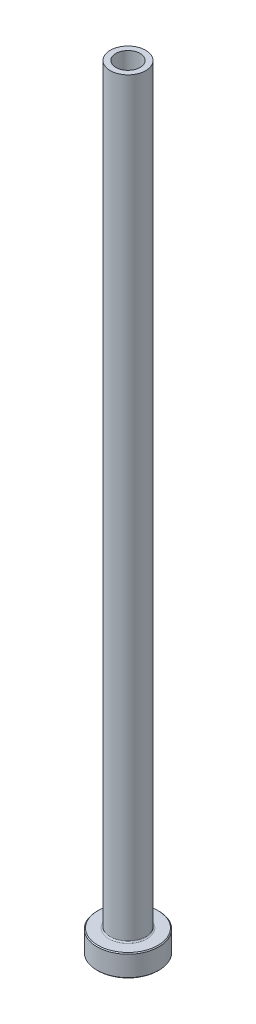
ISO-10303-21;
HEADER;
FILE_DESCRIPTION(('STEP AP214'),'2;1');
FILE_NAME('part.step','',(''),(''),'','','');
FILE_SCHEMA(('AUTOMOTIVE_DESIGN { 1 0 10303 214 1 1 1 1 }'));
ENDSEC;
DATA;
#1=APPLICATION_CONTEXT('core data for automotive mechanical design processes');
#2=APPLICATION_PROTOCOL_DEFINITION('international standard','automotive_design',2000,#1);
#3=PRODUCT_CONTEXT('',#1,'mechanical');
#4=PRODUCT('Part','Part','',(#3));
#5=PRODUCT_RELATED_PRODUCT_CATEGORY('part','',(#4));
#6=PRODUCT_DEFINITION_FORMATION('','',#4);
#7=PRODUCT_DEFINITION_CONTEXT('part definition',#1,'design');
#8=PRODUCT_DEFINITION('design','',#6,#7);
#9=PRODUCT_DEFINITION_SHAPE('','',#8);
#10=(LENGTH_UNIT() NAMED_UNIT(*) SI_UNIT(.MILLI.,.METRE.));
#11=(NAMED_UNIT(*) PLANE_ANGLE_UNIT() SI_UNIT($,.RADIAN.));
#12=(NAMED_UNIT(*) SI_UNIT($,.STERADIAN.) SOLID_ANGLE_UNIT());
#13=UNCERTAINTY_MEASURE_WITH_UNIT(LENGTH_MEASURE(1.E-05),#10,'distance_accuracy_value','');
#14=(GEOMETRIC_REPRESENTATION_CONTEXT(3) GLOBAL_UNCERTAINTY_ASSIGNED_CONTEXT((#13)) GLOBAL_UNIT_ASSIGNED_CONTEXT((#10,
#11,#12)) REPRESENTATION_CONTEXT('',''));
#15=CARTESIAN_POINT('',(0.,0.,0.));
#16=DIRECTION('',(0.,0.,1.));
#17=DIRECTION('',(1.,0.,0.));
#18=AXIS2_PLACEMENT_3D('',#15,#16,#17);
#19=CARTESIAN_POINT('',(0.,92.1876809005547,0.));
#20=DIRECTION('',(0.,1.,0.));
#21=DIRECTION('',(0.,0.,1.));
#22=AXIS2_PLACEMENT_3D('',#19,#20,#21);
#23=CYLINDRICAL_SURFACE('',#22,2.75);
#24=CARTESIAN_POINT('',(0.,175.,0.));
#25=DIRECTION('',(0.,1.,0.));
#26=DIRECTION('',(0.,0.,1.));
#27=AXIS2_PLACEMENT_3D('',#24,#25,#26);
#28=CIRCLE('',#27,2.75);
#29=CARTESIAN_POINT('',(0.,175.,2.75));
#30=VERTEX_POINT('',#29);
#31=EDGE_CURVE('E62',#30,#30,#28,.T.);
#32=ORIENTED_EDGE('',*,*,#31,.T.);
#33=EDGE_LOOP('',(#32));
#34=FACE_BOUND('',#33,.T.);
#35=CARTESIAN_POINT('',(0.,130.,0.));
#36=DIRECTION('',(0.,1.,0.));
#37=DIRECTION('',(0.,0.,1.));
#38=AXIS2_PLACEMENT_3D('',#35,#36,#37);
#39=CIRCLE('',#38,2.75);
#40=CARTESIAN_POINT('',(0.,130.,2.75));
#41=VERTEX_POINT('',#40);
#42=EDGE_CURVE('E71',#41,#41,#39,.T.);
#43=ORIENTED_EDGE('',*,*,#42,.F.);
#44=EDGE_LOOP('',(#43));
#45=FACE_BOUND('',#44,.T.);
#46=ADVANCED_FACE('F30',(#34,#45),#23,.F.);
#47=CARTESIAN_POINT('',(-2.75,175.,0.));
#48=DIRECTION('',(0.,1.,0.));
#49=DIRECTION('',(0.,0.,1.));
#50=AXIS2_PLACEMENT_3D('',#47,#48,#49);
#51=PLANE('',#50);
#52=CARTESIAN_POINT('',(0.,175.,0.));
#53=DIRECTION('',(0.,1.,0.));
#54=DIRECTION('',(0.,0.,1.));
#55=AXIS2_PLACEMENT_3D('',#52,#53,#54);
#56=CIRCLE('',#55,4.00000000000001);
#57=CARTESIAN_POINT('',(0.,175.,4.00000000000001));
#58=VERTEX_POINT('',#57);
#59=EDGE_CURVE('E65',#58,#58,#56,.T.);
#60=ORIENTED_EDGE('',*,*,#59,.T.);
#61=EDGE_LOOP('',(#60));
#62=FACE_BOUND('',#61,.T.);
#63=ORIENTED_EDGE('',*,*,#31,.F.);
#64=EDGE_LOOP('',(#63));
#65=FACE_BOUND('',#64,.T.);
#66=ADVANCED_FACE('F79',(#62,#65),#51,.T.);
#67=CARTESIAN_POINT('',(0.,92.1876809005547,0.));
#68=DIRECTION('',(0.,1.,0.));
#69=DIRECTION('',(0.,0.,1.));
#70=AXIS2_PLACEMENT_3D('',#67,#68,#69);
#71=CYLINDRICAL_SURFACE('',#70,4.);
#72=CARTESIAN_POINT('',(0.,5.3,0.));
#73=DIRECTION('',(0.,1.,0.));
#74=DIRECTION('',(0.,0.,1.));
#75=AXIS2_PLACEMENT_3D('',#72,#73,#74);
#76=CIRCLE('',#75,4.);
#77=CARTESIAN_POINT('',(0.,5.3,4.));
#78=VERTEX_POINT('',#77);
#79=EDGE_CURVE('E59',#78,#78,#76,.T.);
#80=ORIENTED_EDGE('',*,*,#79,.T.);
#81=EDGE_LOOP('',(#80));
#82=FACE_BOUND('',#81,.T.);
#83=ORIENTED_EDGE('',*,*,#59,.F.);
#84=EDGE_LOOP('',(#83));
#85=FACE_BOUND('',#84,.T.);
#86=ADVANCED_FACE('F85',(#82,#85),#71,.T.);
#87=CARTESIAN_POINT('',(-3.99999999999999,5.,0.));
#88=DIRECTION('',(0.,1.,0.));
#89=DIRECTION('',(0.,0.,1.));
#90=AXIS2_PLACEMENT_3D('',#87,#88,#89);
#91=PLANE('',#90);
#92=CARTESIAN_POINT('',(0.,5.,0.));
#93=DIRECTION('',(0.,1.,0.));
#94=DIRECTION('',(0.,0.,1.));
#95=AXIS2_PLACEMENT_3D('',#92,#93,#94);
#96=CIRCLE('',#95,6.79999999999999);
#97=CARTESIAN_POINT('',(0.,5.,6.79999999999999));
#98=VERTEX_POINT('',#97);
#99=EDGE_CURVE('E53',#98,#98,#96,.T.);
#100=ORIENTED_EDGE('',*,*,#99,.T.);
#101=EDGE_LOOP('',(#100));
#102=FACE_BOUND('',#101,.T.);
#103=CARTESIAN_POINT('',(0.,5.,0.));
#104=DIRECTION('',(0.,1.,0.));
#105=DIRECTION('',(0.,0.,1.));
#106=AXIS2_PLACEMENT_3D('',#103,#104,#105);
#107=CIRCLE('',#106,4.3);
#108=CARTESIAN_POINT('',(0.,5.,4.3));
#109=VERTEX_POINT('',#108);
#110=EDGE_CURVE('E56',#109,#109,#107,.F.);
#111=ORIENTED_EDGE('',*,*,#110,.T.);
#112=EDGE_LOOP('',(#111));
#113=FACE_BOUND('',#112,.T.);
#114=ADVANCED_FACE('F111',(#102,#113),#91,.T.);
#115=CARTESIAN_POINT('',(0.,92.1876809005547,0.));
#116=DIRECTION('',(0.,1.,0.));
#117=DIRECTION('',(0.,0.,1.));
#118=AXIS2_PLACEMENT_3D('',#115,#116,#117);
#119=CYLINDRICAL_SURFACE('',#118,6.99999999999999);
#120=CARTESIAN_POINT('',(0.,4.79999999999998,0.));
#121=DIRECTION('',(0.,1.,0.));
#122=DIRECTION('',(0.,0.,1.));
#123=AXIS2_PLACEMENT_3D('',#120,#121,#122);
#124=CIRCLE('',#123,6.99999999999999);
#125=CARTESIAN_POINT('',(0.,4.79999999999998,6.99999999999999));
#126=VERTEX_POINT('',#125);
#127=EDGE_CURVE('E45',#126,#126,#124,.F.);
#128=ORIENTED_EDGE('',*,*,#127,.T.);
#129=EDGE_LOOP('',(#128));
#130=FACE_BOUND('',#129,.T.);
#131=CARTESIAN_POINT('',(0.,0.20000000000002,0.));
#132=DIRECTION('',(0.,-1.,0.));
#133=DIRECTION('',(0.,0.,-1.));
#134=AXIS2_PLACEMENT_3D('',#131,#132,#133);
#135=CIRCLE('',#134,6.99999999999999);
#136=CARTESIAN_POINT('',(0.,0.20000000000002,-6.99999999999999));
#137=VERTEX_POINT('',#136);
#138=EDGE_CURVE('E50',#137,#137,#135,.F.);
#139=ORIENTED_EDGE('',*,*,#138,.T.);
#140=EDGE_LOOP('',(#139));
#141=FACE_BOUND('',#140,.T.);
#142=ADVANCED_FACE('F108',(#130,#141),#119,.T.);
#143=CARTESIAN_POINT('',(-6.99999999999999,0.,0.));
#144=DIRECTION('',(0.,-1.,0.));
#145=DIRECTION('',(0.,0.,-1.));
#146=AXIS2_PLACEMENT_3D('',#143,#144,#145);
#147=PLANE('',#146);
#148=CARTESIAN_POINT('',(0.,0.,0.));
#149=DIRECTION('',(0.,-1.,0.));
#150=DIRECTION('',(0.,0.,-1.));
#151=AXIS2_PLACEMENT_3D('',#148,#149,#150);
#152=CIRCLE('',#151,3.49999999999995);
#153=CARTESIAN_POINT('',(0.,0.,-3.49999999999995));
#154=VERTEX_POINT('',#153);
#155=EDGE_CURVE('E37',#154,#154,#152,.F.);
#156=ORIENTED_EDGE('',*,*,#155,.T.);
#157=EDGE_LOOP('',(#156));
#158=FACE_BOUND('',#157,.T.);
#159=CARTESIAN_POINT('',(0.,0.,0.));
#160=DIRECTION('',(0.,-1.,0.));
#161=DIRECTION('',(0.,0.,-1.));
#162=AXIS2_PLACEMENT_3D('',#159,#160,#161);
#163=CIRCLE('',#162,6.79999999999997);
#164=CARTESIAN_POINT('',(0.,0.,-6.79999999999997));
#165=VERTEX_POINT('',#164);
#166=EDGE_CURVE('E41',#165,#165,#163,.T.);
#167=ORIENTED_EDGE('',*,*,#166,.T.);
#168=EDGE_LOOP('',(#167));
#169=FACE_BOUND('',#168,.T.);
#170=ADVANCED_FACE('F110',(#158,#169),#147,.T.);
#171=CARTESIAN_POINT('',(0.,92.1876809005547,0.));
#172=DIRECTION('',(0.,1.,0.));
#173=DIRECTION('',(0.,0.,1.));
#174=AXIS2_PLACEMENT_3D('',#171,#172,#173);
#175=CYLINDRICAL_SURFACE('',#174,3.);
#176=CARTESIAN_POINT('',(0.,0.499999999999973,0.));
#177=DIRECTION('',(0.,-1.,0.));
#178=DIRECTION('',(0.,0.,-1.));
#179=AXIS2_PLACEMENT_3D('',#176,#177,#178);
#180=CIRCLE('',#179,3.);
#181=CARTESIAN_POINT('',(0.,0.499999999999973,-3.));
#182=VERTEX_POINT('',#181);
#183=EDGE_CURVE('E10',#182,#182,#180,.T.);
#184=ORIENTED_EDGE('',*,*,#183,.T.);
#185=EDGE_LOOP('',(#184));
#186=FACE_BOUND('',#185,.T.);
#187=CARTESIAN_POINT('',(0.,118.,0.));
#188=DIRECTION('',(0.,1.,0.));
#189=DIRECTION('',(0.,0.,1.));
#190=AXIS2_PLACEMENT_3D('',#187,#188,#189);
#191=CIRCLE('',#190,3.);
#192=CARTESIAN_POINT('',(0.,118.,3.));
#193=VERTEX_POINT('',#192);
#194=EDGE_CURVE('E68',#193,#193,#191,.T.);
#195=ORIENTED_EDGE('',*,*,#194,.T.);
#196=EDGE_LOOP('',(#195));
#197=FACE_BOUND('',#196,.T.);
#198=ADVANCED_FACE('F118',(#186,#197),#175,.F.);
#199=CARTESIAN_POINT('',(0.,118.,0.));
#200=DIRECTION('',(0.,-1.,0.));
#201=DIRECTION('',(0.,0.,-1.));
#202=AXIS2_PLACEMENT_3D('',#199,#200,#201);
#203=CONICAL_SURFACE('',#202,3.,0.0208303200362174);
#204=ORIENTED_EDGE('',*,*,#42,.T.);
#205=EDGE_LOOP('',(#204));
#206=FACE_BOUND('',#205,.T.);
#207=ORIENTED_EDGE('',*,*,#194,.F.);
#208=EDGE_LOOP('',(#207));
#209=FACE_BOUND('',#208,.T.);
#210=ADVANCED_FACE('F75',(#206,#209),#203,.F.);
#211=CARTESIAN_POINT('',(0.,5.3,0.));
#212=DIRECTION('',(0.,1.,0.));
#213=DIRECTION('',(0.,0.,1.));
#214=AXIS2_PLACEMENT_3D('',#211,#212,#213);
#215=TOROIDAL_SURFACE('',#214,4.3,0.3);
#216=ORIENTED_EDGE('',*,*,#110,.F.);
#217=EDGE_LOOP('',(#216));
#218=FACE_BOUND('',#217,.T.);
#219=ORIENTED_EDGE('',*,*,#79,.F.);
#220=EDGE_LOOP('',(#219));
#221=FACE_BOUND('',#220,.T.);
#222=ADVANCED_FACE('F90',(#218,#221),#215,.F.);
#223=CARTESIAN_POINT('',(0.,5.,0.));
#224=DIRECTION('',(0.,-1.,0.));
#225=DIRECTION('',(0.,0.,-1.));
#226=AXIS2_PLACEMENT_3D('',#223,#224,#225);
#227=CONICAL_SURFACE('',#226,6.79999999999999,0.785398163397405);
#228=ORIENTED_EDGE('',*,*,#127,.F.);
#229=EDGE_LOOP('',(#228));
#230=FACE_BOUND('',#229,.T.);
#231=ORIENTED_EDGE('',*,*,#99,.F.);
#232=EDGE_LOOP('',(#231));
#233=FACE_BOUND('',#232,.T.);
#234=ADVANCED_FACE('F93',(#230,#233),#227,.T.);
#235=CARTESIAN_POINT('',(0.,0.20000000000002,0.));
#236=DIRECTION('',(0.,1.,0.));
#237=DIRECTION('',(0.,0.,1.));
#238=AXIS2_PLACEMENT_3D('',#235,#236,#237);
#239=CONICAL_SURFACE('',#238,6.99999999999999,0.78539816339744);
#240=ORIENTED_EDGE('',*,*,#166,.F.);
#241=EDGE_LOOP('',(#240));
#242=FACE_BOUND('',#241,.T.);
#243=ORIENTED_EDGE('',*,*,#138,.F.);
#244=EDGE_LOOP('',(#243));
#245=FACE_BOUND('',#244,.T.);
#246=ADVANCED_FACE('F96',(#242,#245),#239,.T.);
#247=CARTESIAN_POINT('',(0.,0.,0.));
#248=DIRECTION('',(0.,-1.,0.));
#249=DIRECTION('',(0.,0.,-1.));
#250=AXIS2_PLACEMENT_3D('',#247,#248,#249);
#251=CONICAL_SURFACE('',#250,3.49999999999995,0.785398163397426);
#252=ORIENTED_EDGE('',*,*,#183,.F.);
#253=EDGE_LOOP('',(#252));
#254=FACE_BOUND('',#253,.T.);
#255=ORIENTED_EDGE('',*,*,#155,.F.);
#256=EDGE_LOOP('',(#255));
#257=FACE_BOUND('',#256,.T.);
#258=ADVANCED_FACE('F32',(#254,#257),#251,.F.);
#259=CLOSED_SHELL('',(#46,#66,#86,#114,#142,#170,#198,#210,#222,#234,#246,#258));
#260=MANIFOLD_SOLID_BREP('B2',#259);
#261=ADVANCED_BREP_SHAPE_REPRESENTATION('',(#18,#260),#14);
#262=SHAPE_DEFINITION_REPRESENTATION(#9,#261);
ENDSEC;
END-ISO-10303-21;
